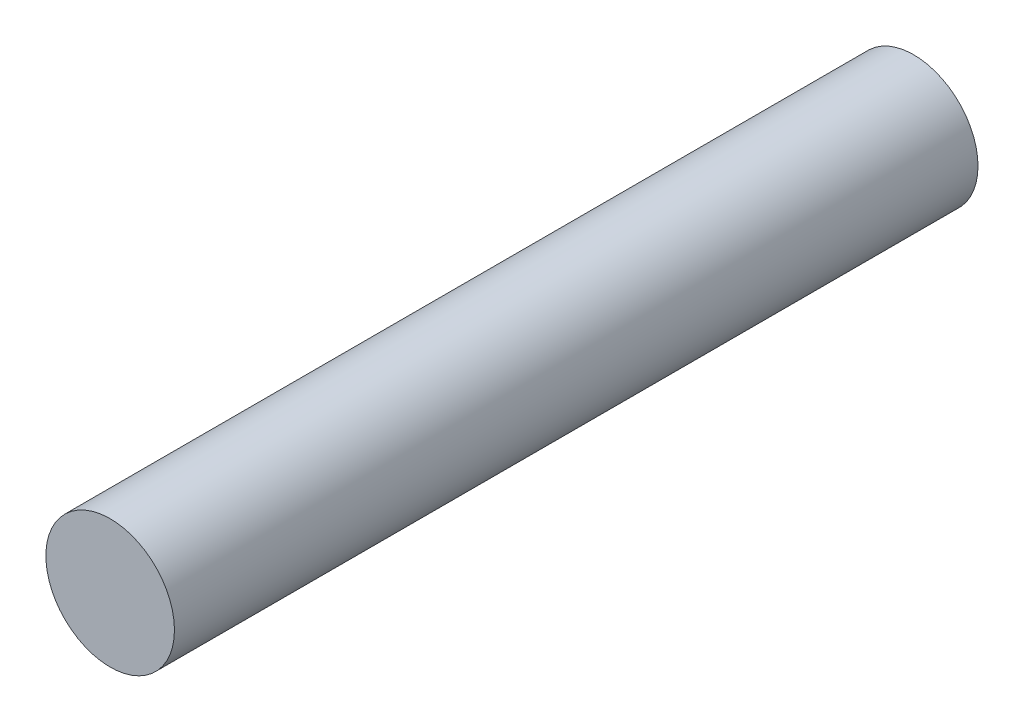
ISO-10303-21;
HEADER;
FILE_DESCRIPTION(('STEP AP214'),'2;1');
FILE_NAME('part.step','',(''),(''),'','','');
FILE_SCHEMA(('AUTOMOTIVE_DESIGN { 1 0 10303 214 1 1 1 1 }'));
ENDSEC;
DATA;
#1=APPLICATION_CONTEXT('core data for automotive mechanical design processes');
#2=APPLICATION_PROTOCOL_DEFINITION('international standard','automotive_design',2000,#1);
#3=PRODUCT_CONTEXT('',#1,'mechanical');
#4=PRODUCT('Part','Part','',(#3));
#5=PRODUCT_RELATED_PRODUCT_CATEGORY('part','',(#4));
#6=PRODUCT_DEFINITION_FORMATION('','',#4);
#7=PRODUCT_DEFINITION_CONTEXT('part definition',#1,'design');
#8=PRODUCT_DEFINITION('design','',#6,#7);
#9=PRODUCT_DEFINITION_SHAPE('','',#8);
#10=(LENGTH_UNIT() NAMED_UNIT(*) SI_UNIT(.MILLI.,.METRE.));
#11=(NAMED_UNIT(*) PLANE_ANGLE_UNIT() SI_UNIT($,.RADIAN.));
#12=(NAMED_UNIT(*) SI_UNIT($,.STERADIAN.) SOLID_ANGLE_UNIT());
#13=UNCERTAINTY_MEASURE_WITH_UNIT(LENGTH_MEASURE(1.E-05),#10,'distance_accuracy_value','');
#14=(GEOMETRIC_REPRESENTATION_CONTEXT(3) GLOBAL_UNCERTAINTY_ASSIGNED_CONTEXT((#13)) GLOBAL_UNIT_ASSIGNED_CONTEXT((#10,
#11,#12)) REPRESENTATION_CONTEXT('',''));
#15=CARTESIAN_POINT('',(0.,0.,0.));
#16=DIRECTION('',(0.,0.,1.));
#17=DIRECTION('',(1.,0.,0.));
#18=AXIS2_PLACEMENT_3D('',#15,#16,#17);
#19=CARTESIAN_POINT('',(0.,0.,50.));
#20=DIRECTION('',(0.,0.,-1.));
#21=DIRECTION('',(-1.,0.,0.));
#22=AXIS2_PLACEMENT_3D('',#19,#20,#21);
#23=CYLINDRICAL_SURFACE('',#22,4.);
#24=CARTESIAN_POINT('',(0.,0.,50.));
#25=DIRECTION('',(0.,0.,1.));
#26=DIRECTION('',(1.,0.,0.));
#27=AXIS2_PLACEMENT_3D('',#24,#25,#26);
#28=CIRCLE('',#27,4.);
#29=CARTESIAN_POINT('',(4.,0.,50.));
#30=VERTEX_POINT('',#29);
#31=EDGE_CURVE('E10',#30,#30,#28,.T.);
#32=ORIENTED_EDGE('',*,*,#31,.F.);
#33=EDGE_LOOP('',(#32));
#34=FACE_BOUND('',#33,.T.);
#35=CARTESIAN_POINT('',(0.,0.,0.));
#36=DIRECTION('',(0.,0.,1.));
#37=DIRECTION('',(1.,0.,0.));
#38=AXIS2_PLACEMENT_3D('',#35,#36,#37);
#39=CIRCLE('',#38,4.);
#40=CARTESIAN_POINT('',(4.,0.,0.));
#41=VERTEX_POINT('',#40);
#42=EDGE_CURVE('E31',#41,#41,#39,.T.);
#43=ORIENTED_EDGE('',*,*,#42,.T.);
#44=EDGE_LOOP('',(#43));
#45=FACE_BOUND('',#44,.T.);
#46=ADVANCED_FACE('F28',(#34,#45),#23,.T.);
#47=CARTESIAN_POINT('',(0.,0.,50.));
#48=DIRECTION('',(0.,0.,1.));
#49=DIRECTION('',(1.,0.,0.));
#50=AXIS2_PLACEMENT_3D('',#47,#48,#49);
#51=PLANE('',#50);
#52=ORIENTED_EDGE('',*,*,#31,.T.);
#53=EDGE_LOOP('',(#52));
#54=FACE_BOUND('',#53,.T.);
#55=ADVANCED_FACE('F43',(#54),#51,.T.);
#56=CARTESIAN_POINT('',(0.,0.,0.));
#57=DIRECTION('',(0.,0.,1.));
#58=DIRECTION('',(1.,0.,0.));
#59=AXIS2_PLACEMENT_3D('',#56,#57,#58);
#60=PLANE('',#59);
#61=ORIENTED_EDGE('',*,*,#42,.F.);
#62=EDGE_LOOP('',(#61));
#63=FACE_BOUND('',#62,.T.);
#64=ADVANCED_FACE('F41',(#63),#60,.F.);
#65=CLOSED_SHELL('',(#46,#55,#64));
#66=MANIFOLD_SOLID_BREP('B2',#65);
#67=ADVANCED_BREP_SHAPE_REPRESENTATION('',(#18,#66),#14);
#68=SHAPE_DEFINITION_REPRESENTATION(#9,#67);
ENDSEC;
END-ISO-10303-21;
